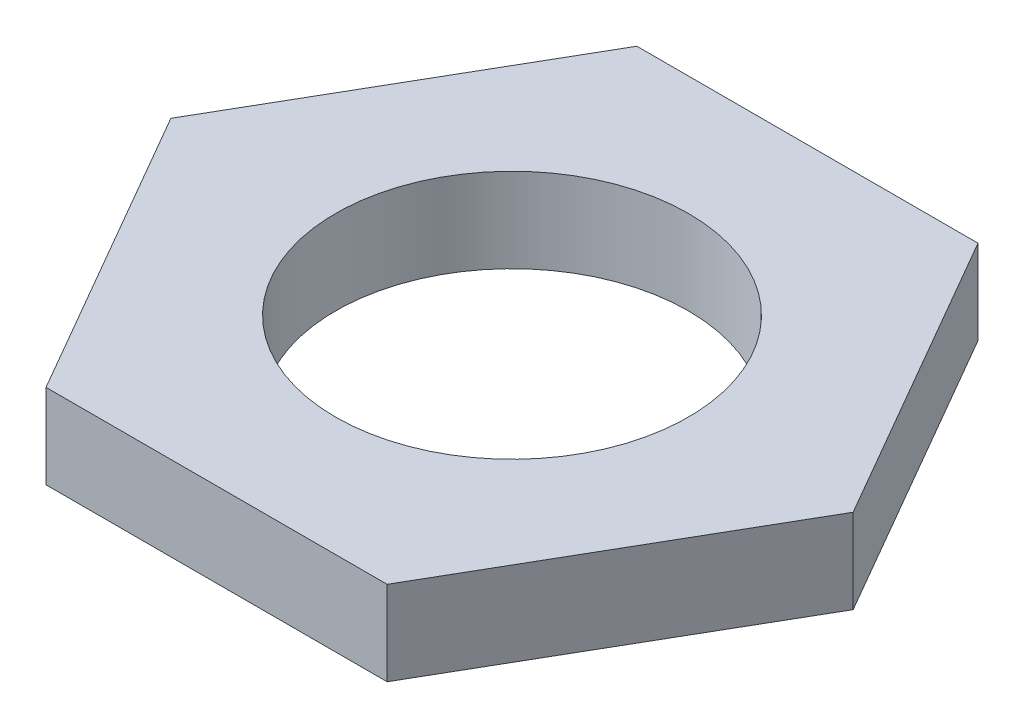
ISO-10303-21;
HEADER;
FILE_DESCRIPTION(('STEP AP214'),'2;1');
FILE_NAME('part.step','',(''),(''),'','','');
FILE_SCHEMA(('AUTOMOTIVE_DESIGN { 1 0 10303 214 1 1 1 1 }'));
ENDSEC;
DATA;
#1=APPLICATION_CONTEXT('core data for automotive mechanical design processes');
#2=APPLICATION_PROTOCOL_DEFINITION('international standard','automotive_design',2000,#1);
#3=PRODUCT_CONTEXT('',#1,'mechanical');
#4=PRODUCT('Part','Part','',(#3));
#5=PRODUCT_RELATED_PRODUCT_CATEGORY('part','',(#4));
#6=PRODUCT_DEFINITION_FORMATION('','',#4);
#7=PRODUCT_DEFINITION_CONTEXT('part definition',#1,'design');
#8=PRODUCT_DEFINITION('design','',#6,#7);
#9=PRODUCT_DEFINITION_SHAPE('','',#8);
#10=(LENGTH_UNIT() NAMED_UNIT(*) SI_UNIT(.MILLI.,.METRE.));
#11=(NAMED_UNIT(*) PLANE_ANGLE_UNIT() SI_UNIT($,.RADIAN.));
#12=(NAMED_UNIT(*) SI_UNIT($,.STERADIAN.) SOLID_ANGLE_UNIT());
#13=UNCERTAINTY_MEASURE_WITH_UNIT(LENGTH_MEASURE(1.E-05),#10,'distance_accuracy_value','');
#14=(GEOMETRIC_REPRESENTATION_CONTEXT(3) GLOBAL_UNCERTAINTY_ASSIGNED_CONTEXT((#13)) GLOBAL_UNIT_ASSIGNED_CONTEXT((#10,
#11,#12)) REPRESENTATION_CONTEXT('',''));
#15=CARTESIAN_POINT('',(0.,0.,0.));
#16=DIRECTION('',(0.,0.,1.));
#17=DIRECTION('',(1.,0.,0.));
#18=AXIS2_PLACEMENT_3D('',#15,#16,#17);
#19=CARTESIAN_POINT('',(0.,0.762,0.));
#20=DIRECTION('',(0.,1.,0.));
#21=DIRECTION('',(0.,0.,1.));
#22=AXIS2_PLACEMENT_3D('',#19,#20,#21);
#23=PLANE('',#22);
#24=DIRECTION('',(0.5,0.,-0.866025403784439));
#25=VECTOR('',#24,1.);
#26=CARTESIAN_POINT('',(1.53979316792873,0.762,2.667));
#27=LINE('',#26,#25);
#28=CARTESIAN_POINT('',(1.53979316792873,0.762,2.667));
#29=VERTEX_POINT('',#28);
#30=CARTESIAN_POINT('',(3.07958633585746,0.762,0.));
#31=VERTEX_POINT('',#30);
#32=EDGE_CURVE('E150',#29,#31,#27,.T.);
#33=ORIENTED_EDGE('',*,*,#32,.T.);
#34=DIRECTION('',(-0.5,0.,-0.866025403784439));
#35=VECTOR('',#34,1.);
#36=CARTESIAN_POINT('',(3.07958633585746,0.762,0.));
#37=LINE('',#36,#35);
#38=CARTESIAN_POINT('',(1.53979316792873,0.762,-2.667));
#39=VERTEX_POINT('',#38);
#40=EDGE_CURVE('E98',#31,#39,#37,.T.);
#41=ORIENTED_EDGE('',*,*,#40,.T.);
#42=DIRECTION('',(-1.,0.,0.));
#43=VECTOR('',#42,1.);
#44=CARTESIAN_POINT('',(1.53979316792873,0.762,-2.667));
#45=LINE('',#44,#43);
#46=CARTESIAN_POINT('',(-1.53979316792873,0.762,-2.667));
#47=VERTEX_POINT('',#46);
#48=EDGE_CURVE('E111',#39,#47,#45,.T.);
#49=ORIENTED_EDGE('',*,*,#48,.T.);
#50=DIRECTION('',(-0.5,0.,0.866025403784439));
#51=VECTOR('',#50,1.);
#52=CARTESIAN_POINT('',(-1.53979316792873,0.762,-2.667));
#53=LINE('',#52,#51);
#54=CARTESIAN_POINT('',(-3.07958633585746,0.762,0.));
#55=VERTEX_POINT('',#54);
#56=EDGE_CURVE('E105',#47,#55,#53,.T.);
#57=ORIENTED_EDGE('',*,*,#56,.T.);
#58=DIRECTION('',(0.5,0.,0.866025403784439));
#59=VECTOR('',#58,1.);
#60=CARTESIAN_POINT('',(-3.07958633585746,0.762,0.));
#61=LINE('',#60,#59);
#62=CARTESIAN_POINT('',(-1.53979316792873,0.762,2.667));
#63=VERTEX_POINT('',#62);
#64=EDGE_CURVE('E109',#55,#63,#61,.T.);
#65=ORIENTED_EDGE('',*,*,#64,.T.);
#66=DIRECTION('',(1.,0.,0.));
#67=VECTOR('',#66,1.);
#68=CARTESIAN_POINT('',(-1.53979316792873,0.762,2.667));
#69=LINE('',#68,#67);
#70=EDGE_CURVE('E61',#63,#29,#69,.T.);
#71=ORIENTED_EDGE('',*,*,#70,.T.);
#72=EDGE_LOOP('',(#33,#41,#49,#57,#65,#71));
#73=FACE_BOUND('',#72,.T.);
#74=CARTESIAN_POINT('',(0.,0.762,0.));
#75=DIRECTION('',(0.,1.,0.));
#76=DIRECTION('',(0.,0.,1.));
#77=AXIS2_PLACEMENT_3D('',#74,#75,#76);
#78=CIRCLE('',#77,1.59258);
#79=CARTESIAN_POINT('',(0.,0.762,-1.59258));
#80=VERTEX_POINT('',#79);
#81=EDGE_CURVE('E138',#80,#80,#78,.T.);
#82=ORIENTED_EDGE('',*,*,#81,.F.);
#83=EDGE_LOOP('',(#82));
#84=FACE_BOUND('',#83,.T.);
#85=ADVANCED_FACE('F43',(#73,#84),#23,.T.);
#86=CARTESIAN_POINT('',(0.,0.,0.));
#87=DIRECTION('',(0.,1.,0.));
#88=DIRECTION('',(0.,0.,1.));
#89=AXIS2_PLACEMENT_3D('',#86,#87,#88);
#90=PLANE('',#89);
#91=DIRECTION('',(0.5,0.,-0.866025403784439));
#92=VECTOR('',#91,1.);
#93=CARTESIAN_POINT('',(1.53979316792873,0.,2.667));
#94=LINE('',#93,#92);
#95=CARTESIAN_POINT('',(1.53979316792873,0.,2.667));
#96=VERTEX_POINT('',#95);
#97=CARTESIAN_POINT('',(3.07958633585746,0.,0.));
#98=VERTEX_POINT('',#97);
#99=EDGE_CURVE('E133',#96,#98,#94,.T.);
#100=ORIENTED_EDGE('',*,*,#99,.F.);
#101=DIRECTION('',(1.,0.,0.));
#102=VECTOR('',#101,1.);
#103=CARTESIAN_POINT('',(-1.53979316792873,0.,2.667));
#104=LINE('',#103,#102);
#105=CARTESIAN_POINT('',(-1.53979316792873,0.,2.667));
#106=VERTEX_POINT('',#105);
#107=EDGE_CURVE('E90',#106,#96,#104,.T.);
#108=ORIENTED_EDGE('',*,*,#107,.F.);
#109=DIRECTION('',(0.5,0.,0.866025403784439));
#110=VECTOR('',#109,1.);
#111=CARTESIAN_POINT('',(-3.07958633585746,0.,0.));
#112=LINE('',#111,#110);
#113=CARTESIAN_POINT('',(-3.07958633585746,0.,0.));
#114=VERTEX_POINT('',#113);
#115=EDGE_CURVE('E84',#114,#106,#112,.T.);
#116=ORIENTED_EDGE('',*,*,#115,.F.);
#117=DIRECTION('',(-0.5,0.,0.866025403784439));
#118=VECTOR('',#117,1.);
#119=CARTESIAN_POINT('',(-1.53979316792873,0.,-2.667));
#120=LINE('',#119,#118);
#121=CARTESIAN_POINT('',(-1.53979316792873,0.,-2.667));
#122=VERTEX_POINT('',#121);
#123=EDGE_CURVE('E120',#122,#114,#120,.T.);
#124=ORIENTED_EDGE('',*,*,#123,.F.);
#125=DIRECTION('',(-1.,0.,0.));
#126=VECTOR('',#125,1.);
#127=CARTESIAN_POINT('',(1.53979316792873,0.,-2.667));
#128=LINE('',#127,#126);
#129=CARTESIAN_POINT('',(1.53979316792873,0.,-2.667));
#130=VERTEX_POINT('',#129);
#131=EDGE_CURVE('E141',#130,#122,#128,.T.);
#132=ORIENTED_EDGE('',*,*,#131,.F.);
#133=DIRECTION('',(-0.5,0.,-0.866025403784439));
#134=VECTOR('',#133,1.);
#135=CARTESIAN_POINT('',(3.07958633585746,0.,0.));
#136=LINE('',#135,#134);
#137=EDGE_CURVE('E137',#98,#130,#136,.T.);
#138=ORIENTED_EDGE('',*,*,#137,.F.);
#139=EDGE_LOOP('',(#100,#108,#116,#124,#132,#138));
#140=FACE_BOUND('',#139,.T.);
#141=CARTESIAN_POINT('',(0.,0.,0.));
#142=DIRECTION('',(0.,1.,0.));
#143=DIRECTION('',(0.,0.,1.));
#144=AXIS2_PLACEMENT_3D('',#141,#142,#143);
#145=CIRCLE('',#144,1.59258);
#146=CARTESIAN_POINT('',(0.,0.,-1.59258));
#147=VERTEX_POINT('',#146);
#148=EDGE_CURVE('E265',#147,#147,#145,.T.);
#149=ORIENTED_EDGE('',*,*,#148,.T.);
#150=EDGE_LOOP('',(#149));
#151=FACE_BOUND('',#150,.T.);
#152=ADVANCED_FACE('F163',(#140,#151),#90,.F.);
#153=CARTESIAN_POINT('',(1.53979316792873,0.762,2.667));
#154=DIRECTION('',(-0.866025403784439,0.,-0.5));
#155=DIRECTION('',(-0.5,0.,0.866025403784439));
#156=AXIS2_PLACEMENT_3D('',#153,#154,#155);
#157=PLANE('',#156);
#158=ORIENTED_EDGE('',*,*,#99,.T.);
#159=DIRECTION('',(0.,-1.,0.));
#160=VECTOR('',#159,1.);
#161=CARTESIAN_POINT('',(3.07958633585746,0.762,0.));
#162=LINE('',#161,#160);
#163=EDGE_CURVE('E11',#31,#98,#162,.T.);
#164=ORIENTED_EDGE('',*,*,#163,.F.);
#165=ORIENTED_EDGE('',*,*,#32,.F.);
#166=DIRECTION('',(0.,-1.,0.));
#167=VECTOR('',#166,1.);
#168=CARTESIAN_POINT('',(1.53979316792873,0.762,2.667));
#169=LINE('',#168,#167);
#170=EDGE_CURVE('E129',#29,#96,#169,.T.);
#171=ORIENTED_EDGE('',*,*,#170,.T.);
#172=EDGE_LOOP('',(#158,#164,#165,#171));
#173=FACE_BOUND('',#172,.T.);
#174=ADVANCED_FACE('F45',(#173),#157,.F.);
#175=CARTESIAN_POINT('',(3.07958633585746,0.762,0.));
#176=DIRECTION('',(-0.866025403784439,0.,0.5));
#177=DIRECTION('',(0.5,0.,0.866025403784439));
#178=AXIS2_PLACEMENT_3D('',#175,#176,#177);
#179=PLANE('',#178);
#180=ORIENTED_EDGE('',*,*,#137,.T.);
#181=DIRECTION('',(0.,-1.,0.));
#182=VECTOR('',#181,1.);
#183=CARTESIAN_POINT('',(1.53979316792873,0.762,-2.667));
#184=LINE('',#183,#182);
#185=EDGE_CURVE('E53',#39,#130,#184,.T.);
#186=ORIENTED_EDGE('',*,*,#185,.F.);
#187=ORIENTED_EDGE('',*,*,#40,.F.);
#188=ORIENTED_EDGE('',*,*,#163,.T.);
#189=EDGE_LOOP('',(#180,#186,#187,#188));
#190=FACE_BOUND('',#189,.T.);
#191=ADVANCED_FACE('F188',(#190),#179,.F.);
#192=CARTESIAN_POINT('',(1.53979316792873,0.762,-2.667));
#193=DIRECTION('',(0.,0.,1.));
#194=DIRECTION('',(1.,0.,0.));
#195=AXIS2_PLACEMENT_3D('',#192,#193,#194);
#196=PLANE('',#195);
#197=ORIENTED_EDGE('',*,*,#131,.T.);
#198=DIRECTION('',(0.,-1.,0.));
#199=VECTOR('',#198,1.);
#200=CARTESIAN_POINT('',(-1.53979316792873,0.762,-2.667));
#201=LINE('',#200,#199);
#202=EDGE_CURVE('E122',#47,#122,#201,.T.);
#203=ORIENTED_EDGE('',*,*,#202,.F.);
#204=ORIENTED_EDGE('',*,*,#48,.F.);
#205=ORIENTED_EDGE('',*,*,#185,.T.);
#206=EDGE_LOOP('',(#197,#203,#204,#205));
#207=FACE_BOUND('',#206,.T.);
#208=ADVANCED_FACE('F160',(#207),#196,.F.);
#209=CARTESIAN_POINT('',(-1.53979316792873,0.762,-2.667));
#210=DIRECTION('',(0.866025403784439,0.,0.5));
#211=DIRECTION('',(0.5,0.,-0.866025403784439));
#212=AXIS2_PLACEMENT_3D('',#209,#210,#211);
#213=PLANE('',#212);
#214=ORIENTED_EDGE('',*,*,#123,.T.);
#215=DIRECTION('',(0.,-1.,0.));
#216=VECTOR('',#215,1.);
#217=CARTESIAN_POINT('',(-3.07958633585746,0.762,0.));
#218=LINE('',#217,#216);
#219=EDGE_CURVE('E117',#55,#114,#218,.T.);
#220=ORIENTED_EDGE('',*,*,#219,.F.);
#221=ORIENTED_EDGE('',*,*,#56,.F.);
#222=ORIENTED_EDGE('',*,*,#202,.T.);
#223=EDGE_LOOP('',(#214,#220,#221,#222));
#224=FACE_BOUND('',#223,.T.);
#225=ADVANCED_FACE('F118',(#224),#213,.F.);
#226=CARTESIAN_POINT('',(-3.07958633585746,0.762,0.));
#227=DIRECTION('',(0.866025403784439,0.,-0.5));
#228=DIRECTION('',(-0.5,0.,-0.866025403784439));
#229=AXIS2_PLACEMENT_3D('',#226,#227,#228);
#230=PLANE('',#229);
#231=ORIENTED_EDGE('',*,*,#115,.T.);
#232=DIRECTION('',(0.,-1.,0.));
#233=VECTOR('',#232,1.);
#234=CARTESIAN_POINT('',(-1.53979316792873,0.762,2.667));
#235=LINE('',#234,#233);
#236=EDGE_CURVE('E123',#63,#106,#235,.T.);
#237=ORIENTED_EDGE('',*,*,#236,.F.);
#238=ORIENTED_EDGE('',*,*,#64,.F.);
#239=ORIENTED_EDGE('',*,*,#219,.T.);
#240=EDGE_LOOP('',(#231,#237,#238,#239));
#241=FACE_BOUND('',#240,.T.);
#242=ADVANCED_FACE('F125',(#241),#230,.F.);
#243=CARTESIAN_POINT('',(-1.53979316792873,0.762,2.667));
#244=DIRECTION('',(0.,0.,-1.));
#245=DIRECTION('',(-1.,0.,0.));
#246=AXIS2_PLACEMENT_3D('',#243,#244,#245);
#247=PLANE('',#246);
#248=ORIENTED_EDGE('',*,*,#107,.T.);
#249=ORIENTED_EDGE('',*,*,#170,.F.);
#250=ORIENTED_EDGE('',*,*,#70,.F.);
#251=ORIENTED_EDGE('',*,*,#236,.T.);
#252=EDGE_LOOP('',(#248,#249,#250,#251));
#253=FACE_BOUND('',#252,.T.);
#254=ADVANCED_FACE('F168',(#253),#247,.F.);
#255=CARTESIAN_POINT('',(0.,0.762,0.));
#256=DIRECTION('',(0.,-1.,0.));
#257=DIRECTION('',(0.,0.,-1.));
#258=AXIS2_PLACEMENT_3D('',#255,#256,#257);
#259=CYLINDRICAL_SURFACE('',#258,1.59258);
#260=CARTESIAN_POINT('',(0.,0.762,-1.59258));
#261=CARTESIAN_POINT('',(0.,0.7540625,-1.59258));
#262=CARTESIAN_POINT('',(0.,0.746125,-1.59258));
#263=CARTESIAN_POINT('',(0.,0.73025,-1.59258));
#264=CARTESIAN_POINT('',(0.,0.7223125,-1.59258));
#265=CARTESIAN_POINT('',(0.,0.7064375,-1.59258));
#266=CARTESIAN_POINT('',(0.,0.6985,-1.59258));
#267=CARTESIAN_POINT('',(0.,0.682625,-1.59258));
#268=CARTESIAN_POINT('',(0.,0.6746875,-1.59258));
#269=CARTESIAN_POINT('',(0.,0.6588125,-1.59258));
#270=CARTESIAN_POINT('',(0.,0.650875,-1.59258));
#271=CARTESIAN_POINT('',(0.,0.635,-1.59258));
#272=CARTESIAN_POINT('',(0.,0.6270625,-1.59258));
#273=CARTESIAN_POINT('',(0.,0.6111875,-1.59258));
#274=CARTESIAN_POINT('',(0.,0.60325,-1.59258));
#275=CARTESIAN_POINT('',(0.,0.587375,-1.59258));
#276=CARTESIAN_POINT('',(0.,0.5794375,-1.59258));
#277=CARTESIAN_POINT('',(0.,0.5635625,-1.59258));
#278=CARTESIAN_POINT('',(0.,0.555625,-1.59258));
#279=CARTESIAN_POINT('',(0.,0.53975,-1.59258));
#280=CARTESIAN_POINT('',(0.,0.5318125,-1.59258));
#281=CARTESIAN_POINT('',(0.,0.5159375,-1.59258));
#282=CARTESIAN_POINT('',(0.,0.508,-1.59258));
#283=CARTESIAN_POINT('',(0.,0.492125,-1.59258));
#284=CARTESIAN_POINT('',(0.,0.4841875,-1.59258));
#285=CARTESIAN_POINT('',(0.,0.4683125,-1.59258));
#286=CARTESIAN_POINT('',(0.,0.460375,-1.59258));
#287=CARTESIAN_POINT('',(0.,0.4445,-1.59258));
#288=CARTESIAN_POINT('',(0.,0.4365625,-1.59258));
#289=CARTESIAN_POINT('',(0.,0.4206875,-1.59258));
#290=CARTESIAN_POINT('',(0.,0.41275,-1.59258));
#291=CARTESIAN_POINT('',(0.,0.396875,-1.59258));
#292=CARTESIAN_POINT('',(0.,0.3889375,-1.59258));
#293=CARTESIAN_POINT('',(0.,0.3730625,-1.59258));
#294=CARTESIAN_POINT('',(0.,0.365125,-1.59258));
#295=CARTESIAN_POINT('',(0.,0.34925,-1.59258));
#296=CARTESIAN_POINT('',(0.,0.3413125,-1.59258));
#297=CARTESIAN_POINT('',(0.,0.3254375,-1.59258));
#298=CARTESIAN_POINT('',(0.,0.3175,-1.59258));
#299=CARTESIAN_POINT('',(0.,0.301625,-1.59258));
#300=CARTESIAN_POINT('',(0.,0.2936875,-1.59258));
#301=CARTESIAN_POINT('',(0.,0.2778125,-1.59258));
#302=CARTESIAN_POINT('',(0.,0.269875,-1.59258));
#303=CARTESIAN_POINT('',(0.,0.254,-1.59258));
#304=CARTESIAN_POINT('',(0.,0.2460625,-1.59258));
#305=CARTESIAN_POINT('',(0.,0.2301875,-1.59258));
#306=CARTESIAN_POINT('',(0.,0.22225,-1.59258));
#307=CARTESIAN_POINT('',(0.,0.206375,-1.59258));
#308=CARTESIAN_POINT('',(0.,0.1984375,-1.59258));
#309=CARTESIAN_POINT('',(0.,0.1825625,-1.59258));
#310=CARTESIAN_POINT('',(0.,0.174625,-1.59258));
#311=CARTESIAN_POINT('',(0.,0.15875,-1.59258));
#312=CARTESIAN_POINT('',(0.,0.1508125,-1.59258));
#313=CARTESIAN_POINT('',(0.,0.1349375,-1.59258));
#314=CARTESIAN_POINT('',(0.,0.127,-1.59258));
#315=CARTESIAN_POINT('',(0.,0.111125,-1.59258));
#316=CARTESIAN_POINT('',(0.,0.1031875,-1.59258));
#317=CARTESIAN_POINT('',(0.,0.0873125,-1.59258));
#318=CARTESIAN_POINT('',(0.,0.079375,-1.59258));
#319=CARTESIAN_POINT('',(0.,0.0635,-1.59258));
#320=CARTESIAN_POINT('',(0.,0.0555625,-1.59258));
#321=CARTESIAN_POINT('',(0.,0.0396875,-1.59258));
#322=CARTESIAN_POINT('',(0.,0.03175,-1.59258));
#323=CARTESIAN_POINT('',(0.,0.015875,-1.59258));
#324=CARTESIAN_POINT('',(0.,0.00793749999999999,-1.59258));
#325=CARTESIAN_POINT('',(0.,0.,-1.59258));
#326=B_SPLINE_CURVE_WITH_KNOTS('',3,(#260,#261,#262,#263,#264,#265,#266,#267,#268,#269,#270,
#271,#272,#273,#274,#275,#276,#277,#278,#279,#280,#281,#282,#283,#284,#285,#286,#287,#288,#289,
#290,#291,#292,#293,#294,#295,#296,#297,#298,#299,#300,#301,#302,#303,#304,#305,#306,#307,#308,
#309,#310,#311,#312,#313,#314,#315,#316,#317,#318,#319,#320,#321,#322,#323,#324,#325),
.UNSPECIFIED.,.F.,.F.,(4,2,2,2,2,2,2,2,2,2,2,2,2,2,2,2,2,2,2,2,2,2,2,2,2,2,2,2,2,2,2,2,4),(0.,
0.0238125,0.0476249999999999,0.0714374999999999,0.09525,0.1190625,0.142875,0.1666875,0.1905,
0.2143125,0.238125,0.2619375,0.28575,0.3095625,0.333375,0.3571875,0.381,0.4048125,0.428625,
0.4524375,0.47625,0.5000625,0.523875,0.5476875,0.5715,0.5953125,0.619125,0.6429375,0.66675,
0.6905625,0.714375,0.7381875,0.762),.UNSPECIFIED.);
#327=EDGE_CURVE('BSEAM170',#80,#147,#326,.T.);
#328=ORIENTED_EDGE('',*,*,#81,.T.);
#329=ORIENTED_EDGE('',*,*,#148,.F.);
#330=ORIENTED_EDGE('',*,*,#327,.T.);
#331=ORIENTED_EDGE('',*,*,#327,.F.);
#332=EDGE_LOOP('',(#328,#330,#329,#331));
#333=FACE_BOUND('',#332,.T.);
#334=ADVANCED_FACE('F170',(#333),#259,.F.);
#335=CLOSED_SHELL('',(#85,#152,#174,#191,#208,#225,#242,#254,#334));
#336=MANIFOLD_SOLID_BREP('B2',#335);
#337=ADVANCED_BREP_SHAPE_REPRESENTATION('',(#18,#336),#14);
#338=SHAPE_DEFINITION_REPRESENTATION(#9,#337);
ENDSEC;
END-ISO-10303-21;
